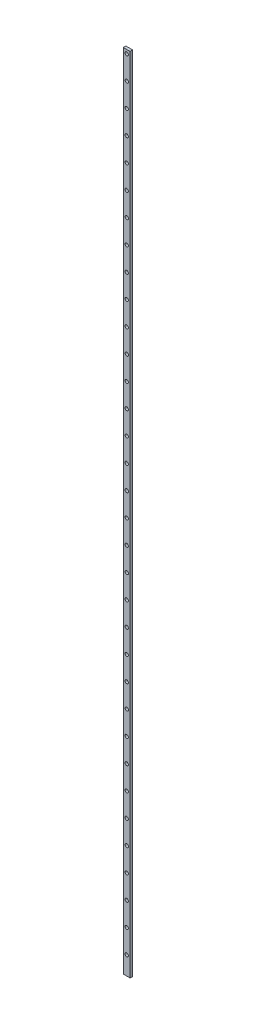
from build123d import *

# Parameters (mm, degrees)
CROQUIS1_W              = 12.7
CROQUIS1_H              = 1500
SALIENTE_EXTRUIR1_DEPTH = 4.8
CROQUIS2_R              = 3.15
CORTAR_EXTRUIR1_DEPTH   = 1501.061442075
MATRIZL1_COUNT          = 34
MATRIZL1_PITCH          = 44.2


with BuildPart() as part:
    # Croquis1 → Saliente-Extruir1 (new body)
    with BuildSketch(Plane.XY):
        with Locations((-6.35, -750)):
            Rectangle(CROQUIS1_W, CROQUIS1_H)
    extrude(amount=SALIENTE_EXTRUIR1_DEPTH)

    # Croquis2 → Cortar-Extruir1 (cut, through all)
    with BuildSketch(Plane.XY.offset(4.8)):
        with Locations((-6.35, -1465.65)):
            Circle(CROQUIS2_R)
    cortar_extruir1 = extrude(amount=-CORTAR_EXTRUIR1_DEPTH, mode=Mode.SUBTRACT)

    # MatrizL1: Cortar-Extruir1 ×34
    with Locations(*[(0, i * MATRIZL1_PITCH, 0) for i in range(1, MATRIZL1_COUNT)]):
        add(cortar_extruir1, mode=Mode.SUBTRACT)


solid = part.part
